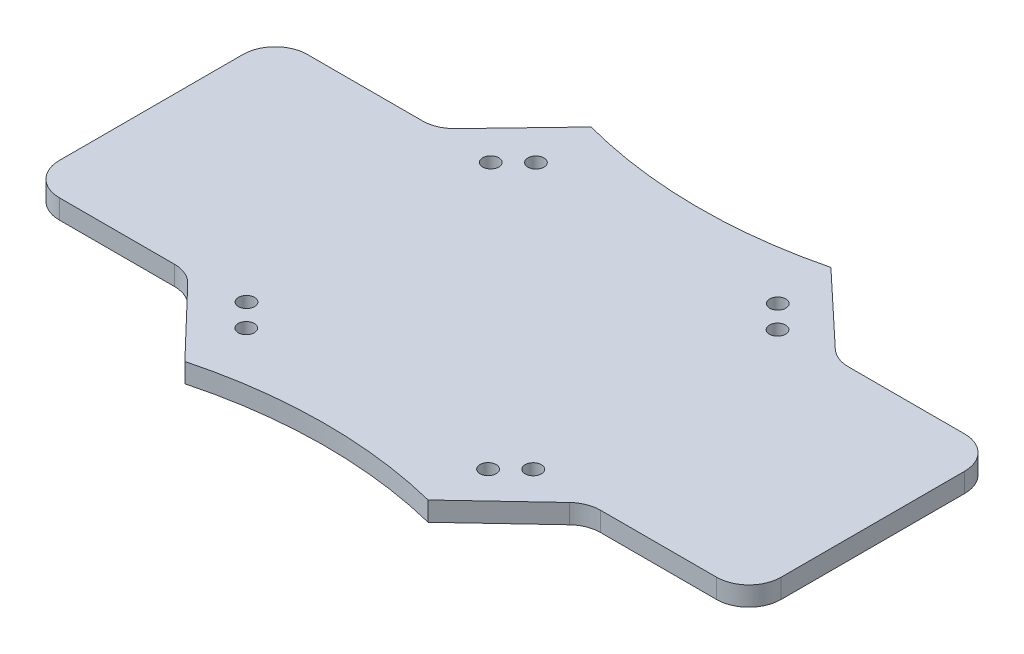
from build123d import *

# Parameters (mm, degrees)
EXTRUDE_1_DEPTH          = 3
SKETCH_2_R               = 2.5
CUT_EXTRUDE_2_DEPTH      = 129.655162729
PATTERN_CIRCULAR_1_COUNT = 4


with BuildPart() as part:
    # Sketch 1 → Extrude 1 (new, symmetric)
    with BuildSketch(Plane(origin=(0, 0, 0), x_dir=(1, 0, 0), z_dir=(0, 1, 0))):
        with BuildLine():
            Line((-112, -28.5), (-112, 28.5))
            ThreePointArc((-112, 28.5), (-109.071067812, 35.571067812), (-102, 38.5))
            Line((-102, 38.5), (-66.267701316, 38.5))
            ThreePointArc((-66.267701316, 38.5), (-62.342509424, 39.302561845), (-59.047359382, 41.581426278))
            Line((-59.047359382, 41.581426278), (-38.5, 63.025002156))
            ThreePointArc((-38.5, 63.025002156), (-1.05045845, 58.003678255), (36.465737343, 62.5))
            Line((36.465737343, 62.5), (59.113129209, 41.213409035))
            ThreePointArc((59.113129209, 41.213409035), (62.278547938, 39.203067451), (65.961894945, 38.5))
            Line((65.961894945, 38.5), (102, 38.5))
            ThreePointArc((102, 38.5), (109.071067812, 35.571067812), (112, 28.5))
            Line((112, 28.5), (112, -28.5))
            ThreePointArc((112, -28.5), (109.071067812, -35.571067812), (102, -38.5))
            Line((102, -38.5), (65.961894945, -38.5))
            ThreePointArc((65.961894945, -38.5), (62.278547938, -39.203067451), (59.113129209, -41.213409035))
            Line((59.113129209, -41.213409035), (36.465737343, -62.5))
            ThreePointArc((36.465737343, -62.5), (-1.05045845, -58.003678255), (-38.5, -63.025002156))
            Line((-38.5, -63.025002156), (-59.047359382, -41.581426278))
            ThreePointArc((-59.047359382, -41.581426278), (-62.342509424, -39.302561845), (-66.267701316, -38.5))
            Line((-66.267701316, -38.5), (-102, -38.5))
            ThreePointArc((-102, -38.5), (-109.071067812, -35.571067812), (-112, -28.5))
        make_face()
    extrude(amount=EXTRUDE_1_DEPTH, both=True)

    # Sketch 2 → Cut-Extrude 2 (cut, through all)
    with BuildSketch(Plane(origin=(0, 3, 0), x_dir=(1, 0, 0), z_dir=(0, 1, 0))):
        with Locations(Location((37.940328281, 44.532471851, 0), (0, 0, 270))):
            Circle(SKETCH_2_R)
        with Locations(Location((44.914250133, 37.487593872, 0), (0, 0, 270))):
            Circle(SKETCH_2_R)
    cut_extrude_2 = extrude(amount=-CUT_EXTRUDE_2_DEPTH, mode=Mode.SUBTRACT)

    # Pattern Circular 1: Cut-Extrude 2 ×4 about axis
    pattern_circular_1_axis = Axis((0, 0, 0), (0, 1, 0))
    for i in range(1, PATTERN_CIRCULAR_1_COUNT):
        add(cut_extrude_2.rotate(pattern_circular_1_axis, i * 360 / PATTERN_CIRCULAR_1_COUNT), mode=Mode.SUBTRACT)


solid = part.part
